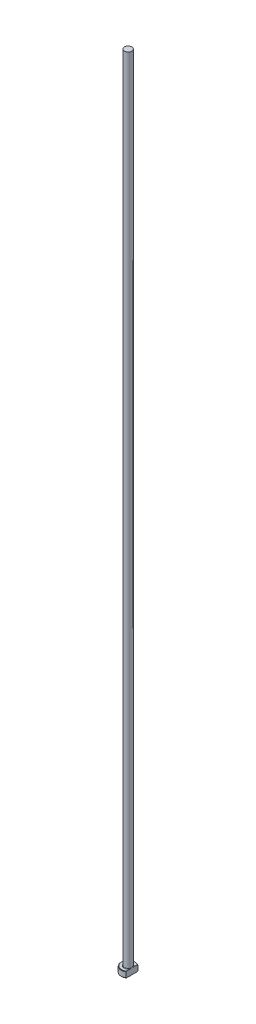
ISO-10303-21;
HEADER;
FILE_DESCRIPTION(('STEP AP214'),'2;1');
FILE_NAME('part.step','',(''),(''),'','','');
FILE_SCHEMA(('AUTOMOTIVE_DESIGN { 1 0 10303 214 1 1 1 1 }'));
ENDSEC;
DATA;
#1=APPLICATION_CONTEXT('core data for automotive mechanical design processes');
#2=APPLICATION_PROTOCOL_DEFINITION('international standard','automotive_design',2000,#1);
#3=PRODUCT_CONTEXT('',#1,'mechanical');
#4=PRODUCT('Part','Part','',(#3));
#5=PRODUCT_RELATED_PRODUCT_CATEGORY('part','',(#4));
#6=PRODUCT_DEFINITION_FORMATION('','',#4);
#7=PRODUCT_DEFINITION_CONTEXT('part definition',#1,'design');
#8=PRODUCT_DEFINITION('design','',#6,#7);
#9=PRODUCT_DEFINITION_SHAPE('','',#8);
#10=(LENGTH_UNIT() NAMED_UNIT(*) SI_UNIT(.MILLI.,.METRE.));
#11=(NAMED_UNIT(*) PLANE_ANGLE_UNIT() SI_UNIT($,.RADIAN.));
#12=(NAMED_UNIT(*) SI_UNIT($,.STERADIAN.) SOLID_ANGLE_UNIT());
#13=UNCERTAINTY_MEASURE_WITH_UNIT(LENGTH_MEASURE(1.E-05),#10,'distance_accuracy_value','');
#14=(GEOMETRIC_REPRESENTATION_CONTEXT(3) GLOBAL_UNCERTAINTY_ASSIGNED_CONTEXT((#13)) GLOBAL_UNIT_ASSIGNED_CONTEXT((#10,
#11,#12)) REPRESENTATION_CONTEXT('',''));
#15=CARTESIAN_POINT('',(0.,0.,0.));
#16=DIRECTION('',(0.,0.,1.));
#17=DIRECTION('',(1.,0.,0.));
#18=AXIS2_PLACEMENT_3D('',#15,#16,#17);
#19=CARTESIAN_POINT('',(0.,0.,0.));
#20=DIRECTION('',(0.,-1.,0.));
#21=DIRECTION('',(0.,0.,-1.));
#22=AXIS2_PLACEMENT_3D('',#19,#20,#21);
#23=PLANE('',#22);
#24=CARTESIAN_POINT('',(0.,0.,0.));
#25=DIRECTION('',(0.,-1.,0.));
#26=DIRECTION('',(0.,0.,-1.));
#27=AXIS2_PLACEMENT_3D('',#24,#25,#26);
#28=CIRCLE('',#27,3.29999999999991);
#29=CARTESIAN_POINT('',(1.84999999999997,0.,2.73267268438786));
#30=VERTEX_POINT('',#29);
#31=CARTESIAN_POINT('',(1.84999999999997,0.,-2.73267268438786));
#32=VERTEX_POINT('',#31);
#33=EDGE_CURVE('E98',#30,#32,#28,.T.);
#34=ORIENTED_EDGE('',*,*,#33,.T.);
#35=DIRECTION('',(0.,0.,1.));
#36=VECTOR('',#35,1.);
#37=CARTESIAN_POINT('',(1.84999999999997,0.,-2.9711109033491));
#38=LINE('',#37,#36);
#39=EDGE_CURVE('E83',#32,#30,#38,.T.);
#40=ORIENTED_EDGE('',*,*,#39,.T.);
#41=EDGE_LOOP('',(#34,#40));
#42=FACE_BOUND('',#41,.T.);
#43=ADVANCED_FACE('F32',(#42),#23,.T.);
#44=CARTESIAN_POINT('',(0.,259.958771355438,0.));
#45=DIRECTION('',(0.,1.,0.));
#46=DIRECTION('',(0.,0.,1.));
#47=AXIS2_PLACEMENT_3D('',#44,#45,#46);
#48=CYLINDRICAL_SURFACE('',#47,3.49999999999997);
#49=CARTESIAN_POINT('',(0.,2.80000000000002,0.));
#50=DIRECTION('',(0.,1.,0.));
#51=DIRECTION('',(0.,0.,1.));
#52=AXIS2_PLACEMENT_3D('',#49,#50,#51);
#53=CIRCLE('',#52,3.49999999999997);
#54=CARTESIAN_POINT('',(1.84999999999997,2.80000000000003,2.9711109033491));
#55=VERTEX_POINT('',#54);
#56=CARTESIAN_POINT('',(1.84999999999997,2.80000000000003,-2.9711109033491));
#57=VERTEX_POINT('',#56);
#58=EDGE_CURVE('E104',#55,#57,#53,.F.);
#59=ORIENTED_EDGE('',*,*,#58,.T.);
#60=DIRECTION('',(0.,-1.,0.));
#61=VECTOR('',#60,1.);
#62=CARTESIAN_POINT('',(1.84999999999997,400.,-2.9711109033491));
#63=LINE('',#62,#61);
#64=CARTESIAN_POINT('',(1.84999999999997,0.200000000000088,-2.9711109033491));
#65=VERTEX_POINT('',#64);
#66=EDGE_CURVE('E183',#57,#65,#63,.T.);
#67=ORIENTED_EDGE('',*,*,#66,.T.);
#68=CARTESIAN_POINT('',(0.,0.200000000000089,0.));
#69=DIRECTION('',(0.,-1.,0.));
#70=DIRECTION('',(0.,0.,-1.));
#71=AXIS2_PLACEMENT_3D('',#68,#69,#70);
#72=CIRCLE('',#71,3.49999999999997);
#73=CARTESIAN_POINT('',(1.84999999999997,0.200000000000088,2.9711109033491));
#74=VERTEX_POINT('',#73);
#75=EDGE_CURVE('E100',#65,#74,#72,.F.);
#76=ORIENTED_EDGE('',*,*,#75,.T.);
#77=DIRECTION('',(0.,-1.,0.));
#78=VECTOR('',#77,1.);
#79=CARTESIAN_POINT('',(1.84999999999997,400.,2.9711109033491));
#80=LINE('',#79,#78);
#81=EDGE_CURVE('E93',#55,#74,#80,.T.);
#82=ORIENTED_EDGE('',*,*,#81,.F.);
#83=EDGE_LOOP('',(#59,#67,#76,#82));
#84=FACE_BOUND('',#83,.T.);
#85=ADVANCED_FACE('F158',(#84),#48,.T.);
#86=CARTESIAN_POINT('',(-3.49999999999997,3.,0.));
#87=DIRECTION('',(0.,1.,0.));
#88=DIRECTION('',(0.,0.,1.));
#89=AXIS2_PLACEMENT_3D('',#86,#87,#88);
#90=PLANE('',#89);
#91=CARTESIAN_POINT('',(0.,3.,0.));
#92=DIRECTION('',(0.,1.,0.));
#93=DIRECTION('',(0.,0.,1.));
#94=AXIS2_PLACEMENT_3D('',#91,#92,#93);
#95=CIRCLE('',#94,3.29999999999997);
#96=CARTESIAN_POINT('',(1.84999999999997,3.,-2.73267268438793));
#97=VERTEX_POINT('',#96);
#98=CARTESIAN_POINT('',(1.84999999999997,3.,2.73267268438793));
#99=VERTEX_POINT('',#98);
#100=EDGE_CURVE('E178',#97,#99,#95,.T.);
#101=ORIENTED_EDGE('',*,*,#100,.T.);
#102=DIRECTION('',(0.,0.,-1.));
#103=VECTOR('',#102,1.);
#104=CARTESIAN_POINT('',(1.84999999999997,3.,0.));
#105=LINE('',#104,#103);
#106=CARTESIAN_POINT('',(1.84999999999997,2.99999999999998,0.883176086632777));
#107=VERTEX_POINT('',#106);
#108=EDGE_CURVE('E57',#99,#107,#105,.T.);
#109=ORIENTED_EDGE('',*,*,#108,.T.);
#110=CARTESIAN_POINT('',(0.,3.,0.));
#111=DIRECTION('',(0.,1.,0.));
#112=DIRECTION('',(0.,0.,1.));
#113=AXIS2_PLACEMENT_3D('',#110,#111,#112);
#114=CIRCLE('',#113,2.04999999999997);
#115=CARTESIAN_POINT('',(1.84999999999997,2.99999999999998,-0.883176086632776));
#116=VERTEX_POINT('',#115);
#117=EDGE_CURVE('E107',#107,#116,#114,.F.);
#118=ORIENTED_EDGE('',*,*,#117,.T.);
#119=EDGE_CURVE('E136',#116,#97,#105,.T.);
#120=ORIENTED_EDGE('',*,*,#119,.T.);
#121=EDGE_LOOP('',(#101,#109,#118,#120));
#122=FACE_BOUND('',#121,.T.);
#123=ADVANCED_FACE('F147',(#122),#90,.T.);
#124=CARTESIAN_POINT('',(0.,3.,0.));
#125=DIRECTION('',(0.,-1.,0.));
#126=DIRECTION('',(0.,0.,-1.));
#127=AXIS2_PLACEMENT_3D('',#124,#125,#126);
#128=CONICAL_SURFACE('',#127,3.29999999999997,0.785398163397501);
#129=ORIENTED_EDGE('',*,*,#58,.F.);
#130=CARTESIAN_POINT('',(1.84999999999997,-0.495337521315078,6.53866286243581));
#131=CARTESIAN_POINT('',(1.84999999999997,-0.367557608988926,6.40586293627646));
#132=CARTESIAN_POINT('',(1.84999999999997,-0.239923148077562,6.27292282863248));
#133=CARTESIAN_POINT('',(1.84999999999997,0.014985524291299,6.00669544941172));
#134=CARTESIAN_POINT('',(1.84999999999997,0.142259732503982,5.87340817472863));
#135=CARTESIAN_POINT('',(1.84999999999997,0.523515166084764,5.4728442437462));
#136=CARTESIAN_POINT('',(1.84999999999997,0.776848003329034,5.20494969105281));
#137=CARTESIAN_POINT('',(1.84999999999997,1.27905662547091,4.66864873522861));
#138=CARTESIAN_POINT('',(1.84999999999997,1.5279514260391,4.40026022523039));
#139=CARTESIAN_POINT('',(1.84999999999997,1.89802867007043,3.99472739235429));
#140=CARTESIAN_POINT('',(1.84999999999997,2.02083571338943,3.85906701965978));
#141=CARTESIAN_POINT('',(1.84999999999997,2.26498704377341,3.58643788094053));
#142=CARTESIAN_POINT('',(1.84999999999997,2.38633136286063,3.44946914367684));
#143=CARTESIAN_POINT('',(1.84999999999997,2.59253936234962,3.2132623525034));
#144=CARTESIAN_POINT('',(1.84999999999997,2.67789611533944,3.11445520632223));
#145=CARTESIAN_POINT('',(1.84999999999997,2.84729764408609,2.91570924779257));
#146=CARTESIAN_POINT('',(1.84999999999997,2.93134233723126,2.81577036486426));
#147=CARTESIAN_POINT('',(1.84999999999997,3.0980891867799,2.61399668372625));
#148=CARTESIAN_POINT('',(1.84999999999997,3.18078335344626,2.51215526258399));
#149=CARTESIAN_POINT('',(1.84999999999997,3.34381050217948,2.30661634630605));
#150=CARTESIAN_POINT('',(1.84999999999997,3.42414384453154,2.20291913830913));
#151=CARTESIAN_POINT('',(1.84999999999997,3.5821731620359,1.99223162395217));
#152=CARTESIAN_POINT('',(1.84999999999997,3.65984318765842,1.88522173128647));
#153=CARTESIAN_POINT('',(1.84999999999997,3.81046673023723,1.6677657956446));
#154=CARTESIAN_POINT('',(1.84999999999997,3.88341650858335,1.55731712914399));
#155=CARTESIAN_POINT('',(1.84999999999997,4.0218682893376,1.33238021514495));
#156=CARTESIAN_POINT('',(1.84999999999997,4.08739797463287,1.21790922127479));
#157=CARTESIAN_POINT('',(1.84999999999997,4.20734088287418,0.983288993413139));
#158=CARTESIAN_POINT('',(1.84999999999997,4.26177391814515,0.863150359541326));
#159=CARTESIAN_POINT('',(1.84999999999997,4.33092920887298,0.676855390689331));
#160=CARTESIAN_POINT('',(1.84999999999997,4.35204213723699,0.613084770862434));
#161=CARTESIAN_POINT('',(1.84999999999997,4.38874877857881,0.483954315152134));
#162=CARTESIAN_POINT('',(1.84999999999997,4.40434337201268,0.418594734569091));
#163=CARTESIAN_POINT('',(1.84999999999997,4.42895642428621,0.287118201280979));
#164=CARTESIAN_POINT('',(1.84999999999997,4.43802196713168,0.221010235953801));
#165=CARTESIAN_POINT('',(1.84999999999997,4.44908005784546,0.0882006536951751));
#166=CARTESIAN_POINT('',(1.84999999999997,4.45107360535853,0.0214991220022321));
#167=CARTESIAN_POINT('',(1.84999999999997,4.4478217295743,-0.111919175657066));
#168=CARTESIAN_POINT('',(1.84999999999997,4.44255503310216,-0.178635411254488));
#169=CARTESIAN_POINT('',(1.84999999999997,4.42516665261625,-0.311161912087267));
#170=CARTESIAN_POINT('',(1.84999999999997,4.41304353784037,-0.376971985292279));
#171=CARTESIAN_POINT('',(1.84999999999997,4.38266710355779,-0.507684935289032));
#172=CARTESIAN_POINT('',(1.84999999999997,4.36436596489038,-0.572576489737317));
#173=CARTESIAN_POINT('',(1.84999999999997,4.32268266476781,-0.700682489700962));
#174=CARTESIAN_POINT('',(1.84999999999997,4.29930023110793,-0.763896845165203));
#175=CARTESIAN_POINT('',(1.84999999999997,4.24376239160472,-0.900089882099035));
#176=CARTESIAN_POINT('',(1.84999999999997,4.21078445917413,-0.972729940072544));
#177=CARTESIAN_POINT('',(1.84999999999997,4.14042488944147,-1.11586336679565));
#178=CARTESIAN_POINT('',(1.84999999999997,4.10304078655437,-1.18635550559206));
#179=CARTESIAN_POINT('',(1.84999999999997,4.02485037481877,-1.32556755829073));
#180=CARTESIAN_POINT('',(1.84999999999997,3.98403800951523,-1.39428404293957));
#181=CARTESIAN_POINT('',(1.84999999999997,3.89981091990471,-1.53011006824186));
#182=CARTESIAN_POINT('',(1.84999999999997,3.85639567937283,-1.59721928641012));
#183=CARTESIAN_POINT('',(1.84999999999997,3.72220240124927,-1.79793775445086));
#184=CARTESIAN_POINT('',(1.84999999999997,3.62833192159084,-1.92947392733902));
#185=CARTESIAN_POINT('',(1.84999999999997,3.43561136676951,-2.1885260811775));
#186=CARTESIAN_POINT('',(1.84999999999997,3.33676758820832,-2.31604682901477));
#187=CARTESIAN_POINT('',(1.84999999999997,3.1617310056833,-2.53562533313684));
#188=CARTESIAN_POINT('',(1.84999999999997,3.08631223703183,-2.6283029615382));
#189=CARTESIAN_POINT('',(1.84999999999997,2.93402806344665,-2.8124618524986));
#190=CARTESIAN_POINT('',(1.84999999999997,2.85716263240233,-2.9039430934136));
#191=CARTESIAN_POINT('',(1.84999999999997,2.62487459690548,-3.17698997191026));
#192=CARTESIAN_POINT('',(1.84999999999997,2.46778137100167,-3.35713267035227));
#193=CARTESIAN_POINT('',(1.84999999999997,2.15058675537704,-3.71509804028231));
#194=CARTESIAN_POINT('',(1.84999999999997,1.99048215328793,-3.89291784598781));
#195=CARTESIAN_POINT('',(1.84999999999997,1.6683447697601,-4.24677354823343));
#196=CARTESIAN_POINT('',(1.84999999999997,1.50631214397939,-4.42280958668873));
#197=CARTESIAN_POINT('',(1.84999999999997,1.19192013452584,-4.76168963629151));
#198=CARTESIAN_POINT('',(1.84999999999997,1.03965111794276,-4.92461766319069));
#199=CARTESIAN_POINT('',(1.84999999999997,0.734208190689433,-5.24963033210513));
#200=CARTESIAN_POINT('',(1.84999999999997,0.581034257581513,-5.41171495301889));
#201=CARTESIAN_POINT('',(1.84999999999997,0.274298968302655,-5.73490774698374));
#202=CARTESIAN_POINT('',(1.84999999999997,0.120738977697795,-5.89601721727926));
#203=CARTESIAN_POINT('',(1.84999999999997,-0.186924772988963,-6.21770486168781));
#204=CARTESIAN_POINT('',(1.84999999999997,-0.341028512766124,-6.3782830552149));
#205=CARTESIAN_POINT('',(1.84999999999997,-0.495337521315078,-6.53866286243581));
#206=B_SPLINE_CURVE_WITH_KNOTS('',3,(#130,#131,#132,#133,#134,#135,#136,#137,#138,#139,#140,
#141,#142,#143,#144,#145,#146,#147,#148,#149,#150,#151,#152,#153,#154,#155,#156,#157,#158,#159,
#160,#161,#162,#163,#164,#165,#166,#167,#168,#169,#170,#171,#172,#173,#174,#175,#176,#177,#178,
#179,#180,#181,#182,#183,#184,#185,#186,#187,#188,#189,#190,#191,#192,#193,#194,#195,#196,#197,
#198,#199,#200,#201,#202,#203,#204,#205),.UNSPECIFIED.,.F.,.F.,(4,2,2,2,2,2,2,2,2,2,2,2,2,2,2,2,
2,2,2,2,2,2,2,2,2,2,2,2,2,2,2,2,2,2,2,2,2,4),(0.,0.55287595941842,1.10575688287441,
2.21186966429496,3.30993774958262,3.85890041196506,4.4078510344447,4.7995536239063,
5.19128077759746,5.58481647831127,5.97829180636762,6.37488572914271,6.77179001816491,
7.16716102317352,7.56181981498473,7.76314684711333,7.96444174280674,8.16427006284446,
8.36407013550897,8.56445688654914,8.76488546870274,8.9669024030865,9.16893016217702,
9.40805718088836,9.64731865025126,9.88701207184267,10.1267531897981,10.6113114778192,
11.0952709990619,11.4537140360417,11.812163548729,12.5291632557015,13.2469768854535,
13.9647329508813,14.6337450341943,15.3027737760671,15.970479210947,16.6381599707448),.UNSPECIFIED.);
#207=EDGE_CURVE('E135',#55,#99,#206,.T.);
#208=ORIENTED_EDGE('',*,*,#207,.T.);
#209=ORIENTED_EDGE('',*,*,#100,.F.);
#210=EDGE_CURVE('E127',#97,#57,#206,.T.);
#211=ORIENTED_EDGE('',*,*,#210,.T.);
#212=EDGE_LOOP('',(#129,#208,#209,#211));
#213=FACE_BOUND('',#212,.T.);
#214=ADVANCED_FACE('F143',(#213),#128,.T.);
#215=CARTESIAN_POINT('',(0.,0.200000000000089,0.));
#216=DIRECTION('',(0.,1.,0.));
#217=DIRECTION('',(0.,0.,1.));
#218=AXIS2_PLACEMENT_3D('',#215,#216,#217);
#219=CONICAL_SURFACE('',#218,3.49999999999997,0.78539816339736);
#220=ORIENTED_EDGE('',*,*,#75,.F.);
#221=CARTESIAN_POINT('',(1.84999999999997,3.49533752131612,-6.53866286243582));
#222=CARTESIAN_POINT('',(1.84999999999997,3.36755760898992,-6.40586293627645));
#223=CARTESIAN_POINT('',(1.84999999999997,3.23992314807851,-6.27292282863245));
#224=CARTESIAN_POINT('',(1.84999999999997,2.98501447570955,-6.00669544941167));
#225=CARTESIAN_POINT('',(1.84999999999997,2.85774026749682,-5.87340817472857));
#226=CARTESIAN_POINT('',(1.84999999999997,2.47648483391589,-5.47284424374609));
#227=CARTESIAN_POINT('',(1.84999999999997,2.22315199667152,-5.20494969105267));
#228=CARTESIAN_POINT('',(1.84999999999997,1.72094337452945,-4.66864873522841));
#229=CARTESIAN_POINT('',(1.84999999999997,1.47204857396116,-4.40026022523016));
#230=CARTESIAN_POINT('',(1.84999999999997,1.10197132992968,-3.994727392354));
#231=CARTESIAN_POINT('',(1.84999999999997,0.979164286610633,-3.85906701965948));
#232=CARTESIAN_POINT('',(1.84999999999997,0.735012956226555,-3.58643788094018));
#233=CARTESIAN_POINT('',(1.84999999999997,0.613668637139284,-3.44946914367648));
#234=CARTESIAN_POINT('',(1.84999999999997,0.407460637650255,-3.21326235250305));
#235=CARTESIAN_POINT('',(1.84999999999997,0.322103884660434,-3.11445520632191));
#236=CARTESIAN_POINT('',(1.84999999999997,0.152702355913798,-2.91570924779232));
#237=CARTESIAN_POINT('',(1.84999999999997,0.0686576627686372,-2.81577036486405));
#238=CARTESIAN_POINT('',(1.84999999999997,-0.0980891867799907,-2.61399668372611));
#239=CARTESIAN_POINT('',(1.84999999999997,-0.180783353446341,-2.51215526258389));
#240=CARTESIAN_POINT('',(1.84999999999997,-0.343810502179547,-2.30661634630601));
#241=CARTESIAN_POINT('',(1.84999999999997,-0.424143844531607,-2.20291913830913));
#242=CARTESIAN_POINT('',(1.84999999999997,-0.582173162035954,-1.99223162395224));
#243=CARTESIAN_POINT('',(1.84999999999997,-0.659843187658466,-1.88522173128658));
#244=CARTESIAN_POINT('',(1.84999999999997,-0.810466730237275,-1.66776579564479));
#245=CARTESIAN_POINT('',(1.84999999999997,-0.883416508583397,-1.55731712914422));
#246=CARTESIAN_POINT('',(1.84999999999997,-1.02186828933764,-1.33238021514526));
#247=CARTESIAN_POINT('',(1.84999999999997,-1.08739797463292,-1.21790922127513));
#248=CARTESIAN_POINT('',(1.84999999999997,-1.20734088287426,-0.983288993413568));
#249=CARTESIAN_POINT('',(1.84999999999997,-1.26177391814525,-0.863150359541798));
#250=CARTESIAN_POINT('',(1.84999999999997,-1.33092920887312,-0.676855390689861));
#251=CARTESIAN_POINT('',(1.84999999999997,-1.35204213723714,-0.61308477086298));
#252=CARTESIAN_POINT('',(1.84999999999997,-1.388748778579,-0.483954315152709));
#253=CARTESIAN_POINT('',(1.84999999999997,-1.40434337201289,-0.418594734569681));
#254=CARTESIAN_POINT('',(1.84999999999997,-1.42895642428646,-0.287118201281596));
#255=CARTESIAN_POINT('',(1.84999999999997,-1.43802196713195,-0.221010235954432));
#256=CARTESIAN_POINT('',(1.84999999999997,-1.44908005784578,-0.0882006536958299));
#257=CARTESIAN_POINT('',(1.84999999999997,-1.45107360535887,-0.0214991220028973));
#258=CARTESIAN_POINT('',(1.84999999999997,-1.44782172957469,0.111919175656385));
#259=CARTESIAN_POINT('',(1.84999999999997,-1.44255503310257,0.178635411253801));
#260=CARTESIAN_POINT('',(1.84999999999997,-1.42516665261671,0.311161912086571));
#261=CARTESIAN_POINT('',(1.84999999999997,-1.41304353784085,0.37697198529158));
#262=CARTESIAN_POINT('',(1.84999999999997,-1.38266710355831,0.507684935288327));
#263=CARTESIAN_POINT('',(1.84999999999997,-1.36436596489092,0.572576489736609));
#264=CARTESIAN_POINT('',(1.84999999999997,-1.32268266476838,0.700682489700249));
#265=CARTESIAN_POINT('',(1.84999999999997,-1.29930023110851,0.763896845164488));
#266=CARTESIAN_POINT('',(1.84999999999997,-1.24376239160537,0.900089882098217));
#267=CARTESIAN_POINT('',(1.84999999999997,-1.21078445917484,0.972729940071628));
#268=CARTESIAN_POINT('',(1.84999999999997,-1.1404248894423,1.11586336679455));
#269=CARTESIAN_POINT('',(1.84999999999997,-1.10304078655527,1.18635550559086));
#270=CARTESIAN_POINT('',(1.84999999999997,-1.02485037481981,1.32556755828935));
#271=CARTESIAN_POINT('',(1.84999999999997,-0.984038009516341,1.39428404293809));
#272=CARTESIAN_POINT('',(1.84999999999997,-0.899810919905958,1.5301100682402));
#273=CARTESIAN_POINT('',(1.84999999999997,-0.856395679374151,1.59721928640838));
#274=CARTESIAN_POINT('',(1.84999999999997,-0.72220240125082,1.79793775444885));
#275=CARTESIAN_POINT('',(1.84999999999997,-0.628331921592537,1.92947392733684));
#276=CARTESIAN_POINT('',(1.84999999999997,-0.43561136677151,2.18852608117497));
#277=CARTESIAN_POINT('',(1.84999999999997,-0.336767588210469,2.31604682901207));
#278=CARTESIAN_POINT('',(1.84999999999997,-0.161731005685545,2.53562533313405));
#279=CARTESIAN_POINT('',(1.84999999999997,-0.086312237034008,2.6283029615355));
#280=CARTESIAN_POINT('',(1.84999999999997,0.0659719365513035,2.81246185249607));
#281=CARTESIAN_POINT('',(1.84999999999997,0.142837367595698,2.90394309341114));
#282=CARTESIAN_POINT('',(1.84999999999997,0.375125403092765,3.17698997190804));
#283=CARTESIAN_POINT('',(1.84999999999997,0.532218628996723,3.35713267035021));
#284=CARTESIAN_POINT('',(1.84999999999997,0.849413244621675,3.71509804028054));
#285=CARTESIAN_POINT('',(1.84999999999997,1.00951784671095,3.89291784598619));
#286=CARTESIAN_POINT('',(1.84999999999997,1.33165523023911,4.24677354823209));
#287=CARTESIAN_POINT('',(1.84999999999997,1.49368785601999,4.42280958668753));
#288=CARTESIAN_POINT('',(1.84999999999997,1.80807986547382,4.76168963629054));
#289=CARTESIAN_POINT('',(1.84999999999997,1.96034888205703,4.92461766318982));
#290=CARTESIAN_POINT('',(1.84999999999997,2.26579180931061,5.24963033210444));
#291=CARTESIAN_POINT('',(1.84999999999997,2.41896574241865,5.41171495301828));
#292=CARTESIAN_POINT('',(1.84999999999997,2.72570103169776,5.73490774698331));
#293=CARTESIAN_POINT('',(1.84999999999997,2.87926102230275,5.89601721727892));
#294=CARTESIAN_POINT('',(1.84999999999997,3.18692477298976,6.21770486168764));
#295=CARTESIAN_POINT('',(1.84999999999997,3.34102851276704,6.37828305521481));
#296=CARTESIAN_POINT('',(1.84999999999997,3.49533752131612,6.53866286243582));
#297=B_SPLINE_CURVE_WITH_KNOTS('',3,(#221,#222,#223,#224,#225,#226,#227,#228,#229,#230,#231,
#232,#233,#234,#235,#236,#237,#238,#239,#240,#241,#242,#243,#244,#245,#246,#247,#248,#249,#250,
#251,#252,#253,#254,#255,#256,#257,#258,#259,#260,#261,#262,#263,#264,#265,#266,#267,#268,#269,
#270,#271,#272,#273,#274,#275,#276,#277,#278,#279,#280,#281,#282,#283,#284,#285,#286,#287,#288,
#289,#290,#291,#292,#293,#294,#295,#296),.UNSPECIFIED.,.F.,.F.,(4,2,2,2,2,2,2,2,2,2,2,2,2,2,2,2,
2,2,2,2,2,2,2,2,2,2,2,2,2,2,2,2,2,2,2,2,2,4),(0.,0.552875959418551,1.10575688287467,
2.21186966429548,3.30993774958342,3.85890041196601,4.40785103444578,4.79955362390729,
5.19128077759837,5.58481647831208,5.97829180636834,6.37488572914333,6.77179001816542,
7.16716102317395,7.56181981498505,7.76314684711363,7.96444174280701,8.16427006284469,
8.36407013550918,8.56445688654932,8.7648854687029,8.96690240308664,9.16893016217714,
9.40805718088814,9.6473186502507,9.88701207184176,10.1267531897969,10.6113114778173,
11.0952709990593,11.4537140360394,11.812163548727,12.5291632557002,13.2469768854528,
13.9647329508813,14.6337450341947,15.3027737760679,15.9704792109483,16.6381599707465),.UNSPECIFIED.);
#298=EDGE_CURVE('E86',#65,#32,#297,.T.);
#299=ORIENTED_EDGE('',*,*,#298,.T.);
#300=ORIENTED_EDGE('',*,*,#33,.F.);
#301=EDGE_CURVE('E89',#30,#74,#297,.T.);
#302=ORIENTED_EDGE('',*,*,#301,.T.);
#303=EDGE_LOOP('',(#220,#299,#300,#302));
#304=FACE_BOUND('',#303,.T.);
#305=ADVANCED_FACE('F97',(#304),#219,.T.);
#306=CARTESIAN_POINT('',(0.,3.19999999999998,0.));
#307=DIRECTION('',(0.,1.,0.));
#308=DIRECTION('',(0.,0.,1.));
#309=AXIS2_PLACEMENT_3D('',#306,#307,#308);
#310=TOROIDAL_SURFACE('',#309,2.04999999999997,0.2);
#311=CARTESIAN_POINT('',(1.84999999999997,3.19999999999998,0.));
#312=CARTESIAN_POINT('',(1.84999999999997,3.2000005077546,9.34667894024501E-11));
#313=CARTESIAN_POINT('',(1.84999999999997,3.20000101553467,-1.39523774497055E-07));
#314=CARTESIAN_POINT('',(1.84999999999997,3.20000198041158,-5.58117212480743E-07));
#315=CARTESIAN_POINT('',(1.84999999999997,3.20000243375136,-8.43654614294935E-07));
#316=CARTESIAN_POINT('',(1.84999999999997,3.20000334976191,-1.52578120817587E-06));
#317=CARTESIAN_POINT('',(1.84999999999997,3.20000380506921,-1.93226270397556E-06));
#318=CARTESIAN_POINT('',(1.84999999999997,3.20000464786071,-2.79453374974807E-06));
#319=CARTESIAN_POINT('',(1.84999999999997,3.2000050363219,-3.24942047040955E-06));
#320=CARTESIAN_POINT('',(1.84999999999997,3.20000639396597,-4.93179089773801E-06));
#321=CARTESIAN_POINT('',(1.84999999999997,3.20000728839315,-6.22116400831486E-06));
#322=CARTESIAN_POINT('',(1.84999999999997,3.20000883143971,-8.83821977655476E-06));
#323=CARTESIAN_POINT('',(1.84999999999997,3.20000949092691,-1.0159828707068E-05));
#324=CARTESIAN_POINT('',(1.84999999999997,3.20001208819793,-1.55027353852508E-05));
#325=CARTESIAN_POINT('',(1.84999999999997,3.20001391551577,-1.95815621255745E-05));
#326=CARTESIAN_POINT('',(1.84999999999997,3.20001678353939,-2.74812027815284E-05));
#327=CARTESIAN_POINT('',(1.84999999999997,3.20001789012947,-3.12784972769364E-05));
#328=CARTESIAN_POINT('',(1.84999999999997,3.20002278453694,-4.79402305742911E-05));
#329=CARTESIAN_POINT('',(1.84999999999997,3.20002665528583,-6.07698221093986E-05));
#330=CARTESIAN_POINT('',(1.84999999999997,3.20003266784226,-8.44896575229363E-05));
#331=CARTESIAN_POINT('',(1.84999999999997,3.20003499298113,-9.53309677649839E-05));
#332=CARTESIAN_POINT('',(1.84999999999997,3.20005390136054,-0.000176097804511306));
#333=CARTESIAN_POINT('',(1.84999999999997,3.20007870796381,-0.000243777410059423));
#334=CARTESIAN_POINT('',(1.84999999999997,3.20017277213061,-0.000509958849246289));
#335=CARTESIAN_POINT('',(1.84999999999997,3.20023587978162,-0.000710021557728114));
#336=CARTESIAN_POINT('',(1.84999999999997,3.20048776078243,-0.00149717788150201));
#337=CARTESIAN_POINT('',(1.84999999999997,3.20068297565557,-0.00208268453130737));
#338=CARTESIAN_POINT('',(1.84999999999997,3.20148579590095,-0.00450164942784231));
#339=CARTESIAN_POINT('',(1.84999999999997,3.20208611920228,-0.00633684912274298));
#340=CARTESIAN_POINT('',(1.84999999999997,3.20840458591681,-0.0256382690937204));
#341=CARTESIAN_POINT('',(1.84999999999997,3.21415962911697,-0.0430958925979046));
#342=CARTESIAN_POINT('',(1.84999999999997,3.22539112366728,-0.0773573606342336));
#343=CARTESIAN_POINT('',(1.84999999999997,3.23086978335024,-0.094160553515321));
#344=CARTESIAN_POINT('',(1.84999999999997,3.24243350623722,-0.129835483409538));
#345=CARTESIAN_POINT('',(1.84999999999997,3.24851108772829,-0.148709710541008));
#346=CARTESIAN_POINT('',(1.84999999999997,3.26060732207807,-0.186696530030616));
#347=CARTESIAN_POINT('',(1.84999999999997,3.26662467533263,-0.205809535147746));
#348=CARTESIAN_POINT('',(1.84999999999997,3.28116945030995,-0.252722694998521));
#349=CARTESIAN_POINT('',(1.84999999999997,3.28960449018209,-0.280551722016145));
#350=CARTESIAN_POINT('',(1.84999999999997,3.30577848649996,-0.335676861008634));
#351=CARTESIAN_POINT('',(1.84999999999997,3.31352939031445,-0.362969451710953));
#352=CARTESIAN_POINT('',(1.84999999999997,3.32966638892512,-0.422337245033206));
#353=CARTESIAN_POINT('',(1.84999999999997,3.33793948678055,-0.454443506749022));
#354=CARTESIAN_POINT('',(1.84999999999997,3.35343207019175,-0.519160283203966));
#355=CARTESIAN_POINT('',(1.84999999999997,3.36064342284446,-0.551772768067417));
#356=CARTESIAN_POINT('',(1.84999999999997,3.37406239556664,-0.619533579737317));
#357=CARTESIAN_POINT('',(1.84999999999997,3.38016747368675,-0.654702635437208));
#358=CARTESIAN_POINT('',(1.84999999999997,3.39023253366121,-0.72534332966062));
#359=CARTESIAN_POINT('',(1.84999999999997,3.39419343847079,-0.76081483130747));
#360=CARTESIAN_POINT('',(1.84999999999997,3.3992299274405,-0.830684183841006));
#361=CARTESIAN_POINT('',(1.84999999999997,3.40040481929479,-0.865074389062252));
#362=CARTESIAN_POINT('',(1.84999999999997,3.39935188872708,-0.933419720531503));
#363=CARTESIAN_POINT('',(1.84999999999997,3.39716621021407,-0.967374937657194));
#364=CARTESIAN_POINT('',(1.84999999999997,3.3892911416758,-1.02700506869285));
#365=CARTESIAN_POINT('',(1.84999999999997,3.3845176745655,-1.0527972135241));
#366=CARTESIAN_POINT('',(1.84999999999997,3.37142827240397,-1.10352321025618));
#367=CARTESIAN_POINT('',(1.84999999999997,3.36311751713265,-1.12845825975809));
#368=CARTESIAN_POINT('',(1.84999999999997,3.34739902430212,-1.16341995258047));
#369=CARTESIAN_POINT('',(1.84999999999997,3.34188173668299,-1.17429318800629));
#370=CARTESIAN_POINT('',(1.84999999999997,3.32959648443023,-1.19534735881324));
#371=CARTESIAN_POINT('',(1.84999999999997,3.32282672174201,-1.20552726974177));
#372=CARTESIAN_POINT('',(1.84999999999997,3.30772953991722,-1.22494096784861));
#373=CARTESIAN_POINT('',(1.84999999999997,3.29937943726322,-1.23415748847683));
#374=CARTESIAN_POINT('',(1.84999999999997,3.28103367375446,-1.25077218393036));
#375=CARTESIAN_POINT('',(1.84999999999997,3.2710465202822,-1.25817929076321));
#376=CARTESIAN_POINT('',(1.84999999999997,3.25422744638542,-1.26760493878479));
#377=CARTESIAN_POINT('',(1.84999999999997,3.24792179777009,-1.27056416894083));
#378=CARTESIAN_POINT('',(1.84999999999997,3.2349110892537,-1.27542089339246));
#379=CARTESIAN_POINT('',(1.84999999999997,3.22820636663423,-1.27731927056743));
#380=CARTESIAN_POINT('',(1.84999999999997,3.21452301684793,-1.27990697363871));
#381=CARTESIAN_POINT('',(1.84999999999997,3.20754302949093,-1.28058924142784));
#382=CARTESIAN_POINT('',(1.84999999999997,3.193576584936,-1.28065770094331));
#383=CARTESIAN_POINT('',(1.84999999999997,3.18659012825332,-1.28004398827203));
#384=CARTESIAN_POINT('',(1.84999999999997,3.17336954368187,-1.27767477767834));
#385=CARTESIAN_POINT('',(1.84999999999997,3.16711869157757,-1.27600999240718));
#386=CARTESIAN_POINT('',(1.84999999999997,3.15494695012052,-1.2717474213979));
#387=CARTESIAN_POINT('',(1.84999999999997,3.14902619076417,-1.26914927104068));
#388=CARTESIAN_POINT('',(1.84999999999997,3.13522495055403,-1.26192664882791));
#389=CARTESIAN_POINT('',(1.84999999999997,3.12755069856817,-1.25690871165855));
#390=CARTESIAN_POINT('',(1.84999999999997,3.11310151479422,-1.24571119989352));
#391=CARTESIAN_POINT('',(1.84999999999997,3.10632887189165,-1.23952876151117));
#392=CARTESIAN_POINT('',(1.84999999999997,3.0902441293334,-1.22278329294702));
#393=CARTESIAN_POINT('',(1.84999999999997,3.08152632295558,-1.21165307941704));
#394=CARTESIAN_POINT('',(1.84999999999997,3.06587834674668,-1.18823434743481));
#395=CARTESIAN_POINT('',(1.84999999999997,3.05894991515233,-1.17594471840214));
#396=CARTESIAN_POINT('',(1.84999999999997,3.04177106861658,-1.14085188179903));
#397=CARTESIAN_POINT('',(1.84999999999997,3.03310568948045,-1.11728001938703));
#398=CARTESIAN_POINT('',(1.84999999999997,3.01913803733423,-1.06899459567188));
#399=CARTESIAN_POINT('',(1.84999999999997,3.01387019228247,-1.04427198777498));
#400=CARTESIAN_POINT('',(1.84999999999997,3.00587460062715,-0.993668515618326));
#401=CARTESIAN_POINT('',(1.84999999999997,3.00322848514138,-0.967775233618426));
#402=CARTESIAN_POINT('',(1.84999999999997,3.00014743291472,-0.915820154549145));
#403=CARTESIAN_POINT('',(1.84999999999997,2.99971730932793,-0.889758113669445));
#404=CARTESIAN_POINT('',(1.84999999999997,3.00104547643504,-0.813795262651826));
#405=CARTESIAN_POINT('',(1.84999999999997,3.00517104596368,-0.763940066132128));
#406=CARTESIAN_POINT('',(1.84999999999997,3.01814671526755,-0.66244627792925));
#407=CARTESIAN_POINT('',(1.84999999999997,3.02721778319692,-0.610839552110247));
#408=CARTESIAN_POINT('',(1.84999999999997,3.04894158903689,-0.507119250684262));
#409=CARTESIAN_POINT('',(1.84999999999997,3.0616746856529,-0.455023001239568));
#410=CARTESIAN_POINT('',(1.84999999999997,3.08496950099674,-0.368082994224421));
#411=CARTESIAN_POINT('',(1.84999999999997,3.09491636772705,-0.333068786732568));
#412=CARTESIAN_POINT('',(1.84999999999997,3.11545203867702,-0.263636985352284));
#413=CARTESIAN_POINT('',(1.84999999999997,3.12603282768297,-0.229217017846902));
#414=CARTESIAN_POINT('',(1.84999999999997,3.14646003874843,-0.164292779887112));
#415=CARTESIAN_POINT('',(1.84999999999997,3.15625955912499,-0.133773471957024));
#416=CARTESIAN_POINT('',(1.84999999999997,3.17649314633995,-0.0715631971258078));
#417=CARTESIAN_POINT('',(1.84999999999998,3.18693679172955,-0.0398752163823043));
#418=CARTESIAN_POINT('',(1.84999999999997,3.19791459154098,-0.00633433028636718));
#419=CARTESIAN_POINT('',(1.84999999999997,3.19851581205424,-0.00449665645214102));
#420=CARTESIAN_POINT('',(1.84999999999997,3.19931885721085,-0.00207711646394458));
#421=CARTESIAN_POINT('',(1.84999999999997,3.19951343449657,-0.00149351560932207));
#422=CARTESIAN_POINT('',(1.84999999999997,3.19976454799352,-0.000708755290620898));
#423=CARTESIAN_POINT('',(1.84999999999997,3.19982750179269,-0.000509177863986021));
#424=CARTESIAN_POINT('',(1.84999999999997,3.19992136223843,-0.000243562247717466));
#425=CARTESIAN_POINT('',(1.84999999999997,3.19994613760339,-0.00017596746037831));
#426=CARTESIAN_POINT('',(1.84999999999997,3.19996502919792,-9.52949953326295E-05));
#427=CARTESIAN_POINT('',(1.84999999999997,3.19996735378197,-8.44593557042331E-05));
#428=CARTESIAN_POINT('',(1.84999999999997,3.19997336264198,-6.07523436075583E-05));
#429=CARTESIAN_POINT('',(1.84999999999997,3.19997722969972,-4.79297585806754E-05));
#430=CARTESIAN_POINT('',(1.84999999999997,3.1999821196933,-3.12758458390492E-05));
#431=CARTESIAN_POINT('',(1.84999999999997,3.19998322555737,-2.74793613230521E-05));
#432=CARTESIAN_POINT('',(1.84999999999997,3.19998609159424,-1.95813053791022E-05));
#433=CARTESIAN_POINT('',(1.84999999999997,3.19998791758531,-1.55032186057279E-05));
#434=CARTESIAN_POINT('',(1.84999999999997,3.19999051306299,-1.01610398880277E-05));
#435=CARTESIAN_POINT('',(1.84999999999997,3.19999117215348,-8.83949266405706E-06));
#436=CARTESIAN_POINT('',(1.84999999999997,3.19999271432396,-6.22248600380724E-06));
#437=CARTESIAN_POINT('',(1.84999999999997,3.19999360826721,-4.93309439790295E-06));
#438=CARTESIAN_POINT('',(1.84999999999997,3.19999496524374,-3.25061146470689E-06));
#439=CARTESIAN_POINT('',(1.84999999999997,3.19999535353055,-2.79567390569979E-06));
#440=CARTESIAN_POINT('',(1.84999999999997,3.19999619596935,-1.93326976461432E-06));
#441=CARTESIAN_POINT('',(1.84999999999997,3.19999665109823,-1.52670538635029E-06));
#442=CARTESIAN_POINT('',(1.84999999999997,3.19999756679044,-8.44380236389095E-07));
#443=CARTESIAN_POINT('',(1.84999999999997,3.19999801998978,-5.58732781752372E-07));
#444=CARTESIAN_POINT('',(1.84999999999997,3.19999898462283,-1.39868280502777E-07));
#445=CARTESIAN_POINT('',(1.84999999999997,3.19999949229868,-9.34569741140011E-11));
#446=CARTESIAN_POINT('',(1.84999999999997,3.19999999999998,0.));
#447=B_SPLINE_CURVE_WITH_KNOTS('',3,(#311,#312,#313,#314,#315,#316,#317,#318,#319,#320,#321,
#322,#323,#324,#325,#326,#327,#328,#329,#330,#331,#332,#333,#334,#335,#336,#337,#338,#339,#340,
#341,#342,#343,#344,#345,#346,#347,#348,#349,#350,#351,#352,#353,#354,#355,#356,#357,#358,#359,
#360,#361,#362,#363,#364,#365,#366,#367,#368,#369,#370,#371,#372,#373,#374,#375,#376,#377,#378,
#379,#380,#381,#382,#383,#384,#385,#386,#387,#388,#389,#390,#391,#392,#393,#394,#395,#396,#397,
#398,#399,#400,#401,#402,#403,#404,#405,#406,#407,#408,#409,#410,#411,#412,#413,#414,#415,#416,
#417,#418,#419,#420,#421,#422,#423,#424,#425,#426,#427,#428,#429,#430,#431,#432,#433,#434,#435,
#436,#437,#438,#439,#440,#441,#442,#443,#444,#445,#446),.UNSPECIFIED.,.T.,.F.,(4,2,2,2,2,2,2,2,
2,2,2,2,2,2,2,2,2,2,2,2,2,2,2,2,2,2,2,2,2,2,2,2,2,2,2,2,2,2,2,2,2,2,2,2,2,2,2,2,2,2,2,2,2,2,2,2,
2,2,2,2,2,2,2,2,2,2,2,4),(0.,1.5255475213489E-06,3.12667082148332E-06,4.94899432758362E-06,
6.74187316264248E-06,1.14287265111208E-05,1.58560812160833E-05,2.9231971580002E-05,
4.10845153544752E-05,8.12839315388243E-05,0.000114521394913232,0.000330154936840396,
0.000960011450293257,0.0028109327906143,0.0086043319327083,0.0637452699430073,0.116767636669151,
0.176252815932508,0.236366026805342,0.323600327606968,0.408710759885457,0.508160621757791,
0.608336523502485,0.715371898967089,0.822361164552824,0.925475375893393,1.02730696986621,
1.10584278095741,1.18426398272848,1.22078073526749,1.25735032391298,1.29449125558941,
1.33144496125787,1.35226401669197,1.37306571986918,1.39398776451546,1.41490826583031,
1.43423216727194,1.45356362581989,1.48091639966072,1.50833734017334,1.55051201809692,
1.59272751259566,1.66764967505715,1.74331958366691,1.82127778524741,1.8994052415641,
2.04914452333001,2.2061992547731,2.36700451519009,2.47619575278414,2.5842176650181,
2.680380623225,2.78046602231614,2.7862672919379,2.78811218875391,2.78874051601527,
2.78895587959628,2.78898910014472,2.78902927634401,2.78904112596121,2.78905449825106,
2.78905892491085,2.78906361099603,2.78906540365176,2.78906722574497,2.78906882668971,
2.78907035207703),.UNSPECIFIED.);
#448=CARTESIAN_POINT('',(1.84999999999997,3.19999999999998,0.));
#449=VERTEX_POINT('',#448);
#450=EDGE_CURVE('E11',#116,#449,#447,.T.);
#451=ORIENTED_EDGE('',*,*,#450,.F.);
#452=ORIENTED_EDGE('',*,*,#117,.F.);
#453=CARTESIAN_POINT('',(1.84999999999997,3.19999999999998,0.));
#454=CARTESIAN_POINT('',(1.84999999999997,3.19999949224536,-9.34668148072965E-11));
#455=CARTESIAN_POINT('',(1.84999999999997,3.19999898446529,1.39523774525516E-07));
#456=CARTESIAN_POINT('',(1.84999999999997,3.19999801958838,5.58117212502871E-07));
#457=CARTESIAN_POINT('',(1.84999999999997,3.19999756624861,8.4365461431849E-07));
#458=CARTESIAN_POINT('',(1.84999999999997,3.19999665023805,1.5257812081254E-06));
#459=CARTESIAN_POINT('',(1.84999999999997,3.19999619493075,1.93226270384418E-06));
#460=CARTESIAN_POINT('',(1.84999999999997,3.19999535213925,2.7945337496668E-06));
#461=CARTESIAN_POINT('',(1.84999999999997,3.19999496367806,3.24942047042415E-06));
#462=CARTESIAN_POINT('',(1.84999999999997,3.19999360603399,4.93179089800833E-06));
#463=CARTESIAN_POINT('',(1.84999999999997,3.19999271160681,6.22116400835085E-06));
#464=CARTESIAN_POINT('',(1.84999999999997,3.19999116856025,8.83821977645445E-06));
#465=CARTESIAN_POINT('',(1.84999999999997,3.19999050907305,1.01598287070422E-05));
#466=CARTESIAN_POINT('',(1.84999999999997,3.19998791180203,1.55027353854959E-05));
#467=CARTESIAN_POINT('',(1.84999999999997,3.19998608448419,1.95815621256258E-05));
#468=CARTESIAN_POINT('',(1.84999999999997,3.19998321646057,2.74812027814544E-05));
#469=CARTESIAN_POINT('',(1.84999999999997,3.19998210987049,3.12784972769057E-05));
#470=CARTESIAN_POINT('',(1.84999999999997,3.19997721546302,4.79402305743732E-05));
#471=CARTESIAN_POINT('',(1.84999999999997,3.19997334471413,6.07698221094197E-05));
#472=CARTESIAN_POINT('',(1.84999999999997,3.1999673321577,8.44896575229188E-05));
#473=CARTESIAN_POINT('',(1.84999999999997,3.19996500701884,9.53309677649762E-05));
#474=CARTESIAN_POINT('',(1.84999999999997,3.19994609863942,0.000176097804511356));
#475=CARTESIAN_POINT('',(1.84999999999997,3.19992129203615,0.000243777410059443));
#476=CARTESIAN_POINT('',(1.84999999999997,3.19982722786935,0.000509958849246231));
#477=CARTESIAN_POINT('',(1.84999999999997,3.19976412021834,0.000710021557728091));
#478=CARTESIAN_POINT('',(1.84999999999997,3.19951223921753,0.00149717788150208));
#479=CARTESIAN_POINT('',(1.84999999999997,3.19931702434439,0.0020826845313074));
#480=CARTESIAN_POINT('',(1.84999999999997,3.19851420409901,0.00450164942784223));
#481=CARTESIAN_POINT('',(1.84999999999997,3.19791388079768,0.00633684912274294));
#482=CARTESIAN_POINT('',(1.84999999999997,3.19159541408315,0.0256382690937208));
#483=CARTESIAN_POINT('',(1.84999999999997,3.18584037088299,0.0430958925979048));
#484=CARTESIAN_POINT('',(1.84999999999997,3.17460887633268,0.0773573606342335));
#485=CARTESIAN_POINT('',(1.84999999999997,3.16913021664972,0.0941605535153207));
#486=CARTESIAN_POINT('',(1.84999999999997,3.15756649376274,0.129835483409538));
#487=CARTESIAN_POINT('',(1.84999999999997,3.15148891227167,0.148709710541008));
#488=CARTESIAN_POINT('',(1.84999999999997,3.13939267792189,0.186696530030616));
#489=CARTESIAN_POINT('',(1.84999999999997,3.13337532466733,0.205809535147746));
#490=CARTESIAN_POINT('',(1.84999999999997,3.11883054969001,0.252722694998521));
#491=CARTESIAN_POINT('',(1.84999999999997,3.11039550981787,0.280551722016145));
#492=CARTESIAN_POINT('',(1.84999999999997,3.0942215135,0.335676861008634));
#493=CARTESIAN_POINT('',(1.84999999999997,3.08647060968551,0.362969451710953));
#494=CARTESIAN_POINT('',(1.84999999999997,3.07033361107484,0.422337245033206));
#495=CARTESIAN_POINT('',(1.84999999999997,3.06206051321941,0.454443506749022));
#496=CARTESIAN_POINT('',(1.84999999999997,3.04656792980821,0.519160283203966));
#497=CARTESIAN_POINT('',(1.84999999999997,3.0393565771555,0.551772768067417));
#498=CARTESIAN_POINT('',(1.84999999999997,3.02593760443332,0.619533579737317));
#499=CARTESIAN_POINT('',(1.84999999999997,3.01983252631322,0.654702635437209));
#500=CARTESIAN_POINT('',(1.84999999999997,3.00976746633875,0.72534332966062));
#501=CARTESIAN_POINT('',(1.84999999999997,3.00580656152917,0.76081483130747));
#502=CARTESIAN_POINT('',(1.84999999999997,3.00077007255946,0.830684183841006));
#503=CARTESIAN_POINT('',(1.84999999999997,2.99959518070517,0.865074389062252));
#504=CARTESIAN_POINT('',(1.84999999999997,3.00064811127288,0.933419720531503));
#505=CARTESIAN_POINT('',(1.84999999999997,3.00283378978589,0.967374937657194));
#506=CARTESIAN_POINT('',(1.84999999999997,3.01070885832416,1.02700506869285));
#507=CARTESIAN_POINT('',(1.84999999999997,3.01548232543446,1.0527972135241));
#508=CARTESIAN_POINT('',(1.84999999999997,3.02857172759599,1.10352321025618));
#509=CARTESIAN_POINT('',(1.84999999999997,3.03688248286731,1.12845825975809));
#510=CARTESIAN_POINT('',(1.84999999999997,3.05260097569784,1.16341995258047));
#511=CARTESIAN_POINT('',(1.84999999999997,3.05811826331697,1.17429318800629));
#512=CARTESIAN_POINT('',(1.84999999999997,3.07040351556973,1.19534735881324));
#513=CARTESIAN_POINT('',(1.84999999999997,3.07717327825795,1.20552726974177));
#514=CARTESIAN_POINT('',(1.84999999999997,3.09227046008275,1.22494096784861));
#515=CARTESIAN_POINT('',(1.84999999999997,3.10062056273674,1.23415748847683));
#516=CARTESIAN_POINT('',(1.84999999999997,3.1189663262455,1.25077218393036));
#517=CARTESIAN_POINT('',(1.84999999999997,3.12895347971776,1.25817929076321));
#518=CARTESIAN_POINT('',(1.84999999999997,3.14577255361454,1.26760493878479));
#519=CARTESIAN_POINT('',(1.84999999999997,3.15207820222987,1.27056416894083));
#520=CARTESIAN_POINT('',(1.84999999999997,3.16508891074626,1.27542089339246));
#521=CARTESIAN_POINT('',(1.84999999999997,3.17179363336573,1.27731927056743));
#522=CARTESIAN_POINT('',(1.84999999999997,3.18547698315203,1.27990697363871));
#523=CARTESIAN_POINT('',(1.84999999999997,3.19245697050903,1.28058924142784));
#524=CARTESIAN_POINT('',(1.84999999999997,3.20642341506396,1.28065770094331));
#525=CARTESIAN_POINT('',(1.84999999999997,3.21340987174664,1.28004398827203));
#526=CARTESIAN_POINT('',(1.84999999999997,3.22663045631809,1.27767477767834));
#527=CARTESIAN_POINT('',(1.84999999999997,3.2328813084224,1.27600999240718));
#528=CARTESIAN_POINT('',(1.84999999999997,3.24505304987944,1.2717474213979));
#529=CARTESIAN_POINT('',(1.84999999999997,3.25097380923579,1.26914927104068));
#530=CARTESIAN_POINT('',(1.84999999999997,3.26477504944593,1.26192664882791));
#531=CARTESIAN_POINT('',(1.84999999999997,3.27244930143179,1.25690871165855));
#532=CARTESIAN_POINT('',(1.84999999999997,3.28689848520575,1.24571119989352));
#533=CARTESIAN_POINT('',(1.84999999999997,3.29367112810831,1.23952876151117));
#534=CARTESIAN_POINT('',(1.84999999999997,3.30975587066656,1.22278329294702));
#535=CARTESIAN_POINT('',(1.84999999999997,3.31847367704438,1.21165307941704));
#536=CARTESIAN_POINT('',(1.84999999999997,3.33412165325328,1.18823434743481));
#537=CARTESIAN_POINT('',(1.84999999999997,3.34105008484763,1.17594471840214));
#538=CARTESIAN_POINT('',(1.84999999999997,3.35822893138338,1.14085188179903));
#539=CARTESIAN_POINT('',(1.84999999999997,3.36689431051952,1.11728001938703));
#540=CARTESIAN_POINT('',(1.84999999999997,3.38086196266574,1.06899459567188));
#541=CARTESIAN_POINT('',(1.84999999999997,3.3861298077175,1.04427198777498));
#542=CARTESIAN_POINT('',(1.84999999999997,3.39412539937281,0.993668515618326));
#543=CARTESIAN_POINT('',(1.84999999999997,3.39677151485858,0.967775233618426));
#544=CARTESIAN_POINT('',(1.84999999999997,3.39985256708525,0.915820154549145));
#545=CARTESIAN_POINT('',(1.84999999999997,3.40028269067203,0.889758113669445));
#546=CARTESIAN_POINT('',(1.84999999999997,3.39895452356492,0.813795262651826));
#547=CARTESIAN_POINT('',(1.84999999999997,3.39482895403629,0.763940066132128));
#548=CARTESIAN_POINT('',(1.84999999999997,3.38185328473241,0.66244627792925));
#549=CARTESIAN_POINT('',(1.84999999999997,3.37278221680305,0.610839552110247));
#550=CARTESIAN_POINT('',(1.84999999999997,3.35105841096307,0.507119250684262));
#551=CARTESIAN_POINT('',(1.84999999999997,3.33832531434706,0.455023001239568));
#552=CARTESIAN_POINT('',(1.84999999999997,3.31503049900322,0.368082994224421));
#553=CARTESIAN_POINT('',(1.84999999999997,3.30508363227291,0.333068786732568));
#554=CARTESIAN_POINT('',(1.84999999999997,3.28454796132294,0.263636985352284));
#555=CARTESIAN_POINT('',(1.84999999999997,3.27396717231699,0.229217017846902));
#556=CARTESIAN_POINT('',(1.84999999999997,3.25353996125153,0.164292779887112));
#557=CARTESIAN_POINT('',(1.84999999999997,3.24374044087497,0.133773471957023));
#558=CARTESIAN_POINT('',(1.84999999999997,3.22350685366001,0.0715631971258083));
#559=CARTESIAN_POINT('',(1.84999999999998,3.21306320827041,0.0398752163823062));
#560=CARTESIAN_POINT('',(1.84999999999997,3.20208540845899,0.00633433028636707));
#561=CARTESIAN_POINT('',(1.84999999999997,3.20148418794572,0.00449665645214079));
#562=CARTESIAN_POINT('',(1.84999999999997,3.20068114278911,0.00207711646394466));
#563=CARTESIAN_POINT('',(1.84999999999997,3.20048656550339,0.00149351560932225));
#564=CARTESIAN_POINT('',(1.84999999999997,3.20023545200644,0.000708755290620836));
#565=CARTESIAN_POINT('',(1.84999999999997,3.20017249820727,0.000509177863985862));
#566=CARTESIAN_POINT('',(1.84999999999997,3.20007863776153,0.00024356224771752));
#567=CARTESIAN_POINT('',(1.84999999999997,3.20005386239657,0.000175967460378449));
#568=CARTESIAN_POINT('',(1.84999999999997,3.20003497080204,9.5294995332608E-05));
#569=CARTESIAN_POINT('',(1.84999999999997,3.20003264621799,8.44593557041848E-05));
#570=CARTESIAN_POINT('',(1.84999999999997,3.20002663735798,6.07523436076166E-05));
#571=CARTESIAN_POINT('',(1.84999999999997,3.20002277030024,4.7929758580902E-05));
#572=CARTESIAN_POINT('',(1.84999999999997,3.20001788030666,3.127584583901E-05));
#573=CARTESIAN_POINT('',(1.84999999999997,3.2000167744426,2.74793613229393E-05));
#574=CARTESIAN_POINT('',(1.84999999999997,3.20001390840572,1.95813053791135E-05));
#575=CARTESIAN_POINT('',(1.84999999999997,3.20001208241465,1.5503218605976E-05));
#576=CARTESIAN_POINT('',(1.84999999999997,3.20000948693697,1.01610398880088E-05));
#577=CARTESIAN_POINT('',(1.84999999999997,3.20000882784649,8.83949266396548E-06));
#578=CARTESIAN_POINT('',(1.84999999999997,3.20000728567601,6.22248600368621E-06));
#579=CARTESIAN_POINT('',(1.84999999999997,3.20000639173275,4.93309439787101E-06));
#580=CARTESIAN_POINT('',(1.84999999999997,3.20000503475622,3.25061146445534E-06));
#581=CARTESIAN_POINT('',(1.84999999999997,3.20000464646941,2.7956739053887E-06));
#582=CARTESIAN_POINT('',(1.84999999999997,3.20000380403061,1.93326976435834E-06));
#583=CARTESIAN_POINT('',(1.84999999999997,3.20000334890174,1.52670538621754E-06));
#584=CARTESIAN_POINT('',(1.84999999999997,3.20000243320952,8.44380236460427E-07));
#585=CARTESIAN_POINT('',(1.84999999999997,3.20000198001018,5.58732781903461E-07));
#586=CARTESIAN_POINT('',(1.84999999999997,3.20000101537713,1.3986828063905E-07));
#587=CARTESIAN_POINT('',(1.84999999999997,3.20000050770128,9.34569995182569E-11));
#588=CARTESIAN_POINT('',(1.84999999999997,3.19999999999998,0.));
#589=B_SPLINE_CURVE_WITH_KNOTS('',3,(#453,#454,#455,#456,#457,#458,#459,#460,#461,#462,#463,
#464,#465,#466,#467,#468,#469,#470,#471,#472,#473,#474,#475,#476,#477,#478,#479,#480,#481,#482,
#483,#484,#485,#486,#487,#488,#489,#490,#491,#492,#493,#494,#495,#496,#497,#498,#499,#500,#501,
#502,#503,#504,#505,#506,#507,#508,#509,#510,#511,#512,#513,#514,#515,#516,#517,#518,#519,#520,
#521,#522,#523,#524,#525,#526,#527,#528,#529,#530,#531,#532,#533,#534,#535,#536,#537,#538,#539,
#540,#541,#542,#543,#544,#545,#546,#547,#548,#549,#550,#551,#552,#553,#554,#555,#556,#557,#558,
#559,#560,#561,#562,#563,#564,#565,#566,#567,#568,#569,#570,#571,#572,#573,#574,#575,#576,#577,
#578,#579,#580,#581,#582,#583,#584,#585,#586,#587,#588),.UNSPECIFIED.,.T.,.F.,(4,2,2,2,2,2,2,2,
2,2,2,2,2,2,2,2,2,2,2,2,2,2,2,2,2,2,2,2,2,2,2,2,2,2,2,2,2,2,2,2,2,2,2,2,2,2,2,2,2,2,2,2,2,2,2,2,
2,2,2,2,2,2,2,2,2,2,2,4),(0.,1.52554752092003E-06,3.12667082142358E-06,4.94899432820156E-06,
6.74187316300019E-06,1.14287265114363E-05,1.5856081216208E-05,2.92319715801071E-05,
4.10845153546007E-05,8.12839315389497E-05,0.000114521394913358,0.000330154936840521,
0.000960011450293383,0.00281093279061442,0.00860433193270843,0.0637452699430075,
0.116767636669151,0.176252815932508,0.236366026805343,0.323600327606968,0.408710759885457,
0.508160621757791,0.608336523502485,0.715371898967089,0.822361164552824,0.925475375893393,
1.02730696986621,1.10584278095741,1.18426398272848,1.22078073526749,1.25735032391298,
1.29449125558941,1.33144496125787,1.35226401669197,1.37306571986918,1.39398776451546,
1.41490826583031,1.43423216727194,1.45356362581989,1.48091639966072,1.50833734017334,
1.55051201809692,1.59272751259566,1.66764967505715,1.74331958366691,1.82127778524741,
1.8994052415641,2.04914452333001,2.2061992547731,2.36700451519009,2.47619575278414,
2.5842176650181,2.680380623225,2.78046602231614,2.7862672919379,2.78811218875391,
2.78874051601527,2.78895587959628,2.78898910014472,2.78902927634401,2.78904112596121,
2.78905449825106,2.78905892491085,2.78906361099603,2.78906540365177,2.78906722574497,
2.78906882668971,2.78907035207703),.UNSPECIFIED.);
#590=EDGE_CURVE('E46',#449,#107,#589,.T.);
#591=ORIENTED_EDGE('',*,*,#590,.F.);
#592=CARTESIAN_POINT('',(0.,3.19999999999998,0.));
#593=DIRECTION('',(0.,1.,0.));
#594=DIRECTION('',(0.,0.,1.));
#595=AXIS2_PLACEMENT_3D('',#592,#593,#594);
#596=CIRCLE('',#595,1.84999999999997);
#597=EDGE_CURVE('E103',#449,#449,#596,.T.);
#598=ORIENTED_EDGE('',*,*,#597,.F.);
#599=EDGE_LOOP('',(#451,#452,#591,#598));
#600=FACE_BOUND('',#599,.T.);
#601=ADVANCED_FACE('F34',(#600),#310,.F.);
#602=CARTESIAN_POINT('',(0.,259.958771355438,0.));
#603=DIRECTION('',(0.,1.,0.));
#604=DIRECTION('',(0.,0.,1.));
#605=AXIS2_PLACEMENT_3D('',#602,#603,#604);
#606=CYLINDRICAL_SURFACE('',#605,1.84999999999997);
#607=ORIENTED_EDGE('',*,*,#597,.T.);
#608=EDGE_LOOP('',(#607));
#609=FACE_BOUND('',#608,.T.);
#610=CARTESIAN_POINT('',(0.,400.,0.));
#611=DIRECTION('',(0.,1.,0.));
#612=DIRECTION('',(0.,0.,1.));
#613=AXIS2_PLACEMENT_3D('',#610,#611,#612);
#614=CIRCLE('',#613,1.84999999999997);
#615=CARTESIAN_POINT('',(0.,400.,1.84999999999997));
#616=VERTEX_POINT('',#615);
#617=EDGE_CURVE('E101',#616,#616,#614,.T.);
#618=ORIENTED_EDGE('',*,*,#617,.F.);
#619=EDGE_LOOP('',(#618));
#620=FACE_BOUND('',#619,.T.);
#621=ADVANCED_FACE('F155',(#609,#620),#606,.T.);
#622=CARTESIAN_POINT('',(-1.84999999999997,400.,0.));
#623=DIRECTION('',(0.,1.,0.));
#624=DIRECTION('',(0.,0.,1.));
#625=AXIS2_PLACEMENT_3D('',#622,#623,#624);
#626=PLANE('',#625);
#627=ORIENTED_EDGE('',*,*,#617,.T.);
#628=EDGE_LOOP('',(#627));
#629=FACE_BOUND('',#628,.T.);
#630=ADVANCED_FACE('F121',(#629),#626,.T.);
#631=CARTESIAN_POINT('',(1.84999999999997,400.,-2.9711109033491));
#632=DIRECTION('',(1.,0.,0.));
#633=DIRECTION('',(0.,0.,-1.));
#634=AXIS2_PLACEMENT_3D('',#631,#632,#633);
#635=PLANE('',#634);
#636=ORIENTED_EDGE('',*,*,#66,.F.);
#637=ORIENTED_EDGE('',*,*,#210,.F.);
#638=ORIENTED_EDGE('',*,*,#119,.F.);
#639=ORIENTED_EDGE('',*,*,#450,.T.);
#640=ORIENTED_EDGE('',*,*,#590,.T.);
#641=ORIENTED_EDGE('',*,*,#108,.F.);
#642=ORIENTED_EDGE('',*,*,#207,.F.);
#643=ORIENTED_EDGE('',*,*,#81,.T.);
#644=ORIENTED_EDGE('',*,*,#301,.F.);
#645=ORIENTED_EDGE('',*,*,#39,.F.);
#646=ORIENTED_EDGE('',*,*,#298,.F.);
#647=EDGE_LOOP('',(#636,#637,#638,#639,#640,#641,#642,#643,#644,#645,#646));
#648=FACE_BOUND('',#647,.T.);
#649=ADVANCED_FACE('F85',(#648),#635,.T.);
#650=CLOSED_SHELL('',(#43,#85,#123,#214,#305,#601,#621,#630,#649));
#651=MANIFOLD_SOLID_BREP('B2',#650);
#652=ADVANCED_BREP_SHAPE_REPRESENTATION('',(#18,#651),#14);
#653=SHAPE_DEFINITION_REPRESENTATION(#9,#652);
ENDSEC;
END-ISO-10303-21;
